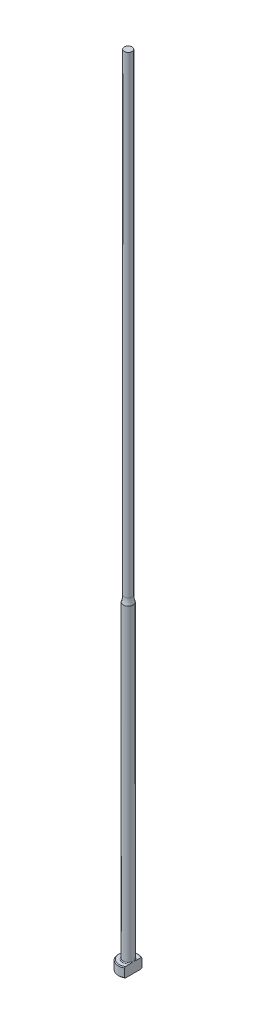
ISO-10303-21;
HEADER;
FILE_DESCRIPTION(('STEP AP214'),'2;1');
FILE_NAME('part.step','',(''),(''),'','','');
FILE_SCHEMA(('AUTOMOTIVE_DESIGN { 1 0 10303 214 1 1 1 1 }'));
ENDSEC;
DATA;
#1=APPLICATION_CONTEXT('core data for automotive mechanical design processes');
#2=APPLICATION_PROTOCOL_DEFINITION('international standard','automotive_design',2000,#1);
#3=PRODUCT_CONTEXT('',#1,'mechanical');
#4=PRODUCT('Part','Part','',(#3));
#5=PRODUCT_RELATED_PRODUCT_CATEGORY('part','',(#4));
#6=PRODUCT_DEFINITION_FORMATION('','',#4);
#7=PRODUCT_DEFINITION_CONTEXT('part definition',#1,'design');
#8=PRODUCT_DEFINITION('design','',#6,#7);
#9=PRODUCT_DEFINITION_SHAPE('','',#8);
#10=(LENGTH_UNIT() NAMED_UNIT(*) SI_UNIT(.MILLI.,.METRE.));
#11=(NAMED_UNIT(*) PLANE_ANGLE_UNIT() SI_UNIT($,.RADIAN.));
#12=(NAMED_UNIT(*) SI_UNIT($,.STERADIAN.) SOLID_ANGLE_UNIT());
#13=UNCERTAINTY_MEASURE_WITH_UNIT(LENGTH_MEASURE(1.E-05),#10,'distance_accuracy_value','');
#14=(GEOMETRIC_REPRESENTATION_CONTEXT(3) GLOBAL_UNCERTAINTY_ASSIGNED_CONTEXT((#13)) GLOBAL_UNIT_ASSIGNED_CONTEXT((#10,
#11,#12)) REPRESENTATION_CONTEXT('',''));
#15=CARTESIAN_POINT('',(0.,0.,0.));
#16=DIRECTION('',(0.,0.,1.));
#17=DIRECTION('',(1.,0.,0.));
#18=AXIS2_PLACEMENT_3D('',#15,#16,#17);
#19=CARTESIAN_POINT('',(-3.17499999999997,3.175,0.));
#20=DIRECTION('',(0.,1.,0.));
#21=DIRECTION('',(0.,0.,1.));
#22=AXIS2_PLACEMENT_3D('',#19,#20,#21);
#23=PLANE('',#22);
#24=CARTESIAN_POINT('',(0.,3.175,0.));
#25=DIRECTION('',(0.,1.,0.));
#26=DIRECTION('',(0.,0.,1.));
#27=AXIS2_PLACEMENT_3D('',#24,#25,#26);
#28=CIRCLE('',#27,2.92099999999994);
#29=CARTESIAN_POINT('',(1.58749999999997,3.175,-2.45195529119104));
#30=VERTEX_POINT('',#29);
#31=CARTESIAN_POINT('',(1.58749999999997,3.175,2.45195529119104));
#32=VERTEX_POINT('',#31);
#33=EDGE_CURVE('E105',#30,#32,#28,.T.);
#34=ORIENTED_EDGE('',*,*,#33,.T.);
#35=DIRECTION('',(0.,0.,1.));
#36=VECTOR('',#35,1.);
#37=CARTESIAN_POINT('',(1.58749999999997,3.17499999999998,2.74963065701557));
#38=LINE('',#37,#36);
#39=CARTESIAN_POINT('',(1.58749999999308,3.175,0.933255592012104));
#40=VERTEX_POINT('',#39);
#41=EDGE_CURVE('E126',#40,#32,#38,.T.);
#42=ORIENTED_EDGE('',*,*,#41,.F.);
#43=CARTESIAN_POINT('',(0.,3.175,0.));
#44=DIRECTION('',(0.,1.,0.));
#45=DIRECTION('',(0.,0.,1.));
#46=AXIS2_PLACEMENT_3D('',#43,#44,#45);
#47=CIRCLE('',#46,1.84149999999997);
#48=CARTESIAN_POINT('',(1.58749999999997,3.17500000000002,-0.933255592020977));
#49=VERTEX_POINT('',#48);
#50=EDGE_CURVE('E11',#40,#49,#47,.F.);
#51=ORIENTED_EDGE('',*,*,#50,.T.);
#52=EDGE_CURVE('E52',#30,#49,#38,.T.);
#53=ORIENTED_EDGE('',*,*,#52,.F.);
#54=EDGE_LOOP('',(#34,#42,#51,#53));
#55=FACE_BOUND('',#54,.T.);
#56=ADVANCED_FACE('F32',(#55),#23,.T.);
#57=CARTESIAN_POINT('',(0.,259.958771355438,0.));
#58=DIRECTION('',(0.,1.,0.));
#59=DIRECTION('',(0.,0.,1.));
#60=AXIS2_PLACEMENT_3D('',#57,#58,#59);
#61=CYLINDRICAL_SURFACE('',#60,3.17499999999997);
#62=CARTESIAN_POINT('',(0.,2.92100000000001,0.));
#63=DIRECTION('',(0.,1.,0.));
#64=DIRECTION('',(0.,0.,1.));
#65=AXIS2_PLACEMENT_3D('',#62,#63,#64);
#66=CIRCLE('',#65,3.17499999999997);
#67=CARTESIAN_POINT('',(1.58749999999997,2.92100000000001,2.74963065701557));
#68=VERTEX_POINT('',#67);
#69=CARTESIAN_POINT('',(1.58749999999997,2.92100000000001,-2.74963065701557));
#70=VERTEX_POINT('',#69);
#71=EDGE_CURVE('E98',#68,#70,#66,.F.);
#72=ORIENTED_EDGE('',*,*,#71,.T.);
#73=DIRECTION('',(0.,-1.,0.));
#74=VECTOR('',#73,1.);
#75=CARTESIAN_POINT('',(1.58749999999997,254.001,-2.74963065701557));
#76=LINE('',#75,#74);
#77=CARTESIAN_POINT('',(1.58749999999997,0.253999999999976,-2.74963065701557));
#78=VERTEX_POINT('',#77);
#79=EDGE_CURVE('E141',#70,#78,#76,.T.);
#80=ORIENTED_EDGE('',*,*,#79,.T.);
#81=CARTESIAN_POINT('',(0.,0.253999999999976,0.));
#82=DIRECTION('',(0.,-1.,0.));
#83=DIRECTION('',(0.,0.,-1.));
#84=AXIS2_PLACEMENT_3D('',#81,#82,#83);
#85=CIRCLE('',#84,3.17499999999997);
#86=CARTESIAN_POINT('',(1.58749999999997,0.253999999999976,2.74963065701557));
#87=VERTEX_POINT('',#86);
#88=EDGE_CURVE('E95',#78,#87,#85,.F.);
#89=ORIENTED_EDGE('',*,*,#88,.T.);
#90=DIRECTION('',(0.,-1.,0.));
#91=VECTOR('',#90,1.);
#92=CARTESIAN_POINT('',(1.58749999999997,254.001,2.74963065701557));
#93=LINE('',#92,#91);
#94=EDGE_CURVE('E88',#68,#87,#93,.T.);
#95=ORIENTED_EDGE('',*,*,#94,.F.);
#96=EDGE_LOOP('',(#72,#80,#89,#95));
#97=FACE_BOUND('',#96,.T.);
#98=ADVANCED_FACE('F191',(#97),#61,.T.);
#99=CARTESIAN_POINT('',(0.,0.,0.));
#100=DIRECTION('',(0.,-1.,0.));
#101=DIRECTION('',(0.,0.,-1.));
#102=AXIS2_PLACEMENT_3D('',#99,#100,#101);
#103=PLANE('',#102);
#104=CARTESIAN_POINT('',(0.,0.,0.));
#105=DIRECTION('',(0.,-1.,0.));
#106=DIRECTION('',(0.,0.,-1.));
#107=AXIS2_PLACEMENT_3D('',#104,#105,#106);
#108=CIRCLE('',#107,2.92100000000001);
#109=CARTESIAN_POINT('',(1.58749999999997,0.,2.45195529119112));
#110=VERTEX_POINT('',#109);
#111=CARTESIAN_POINT('',(1.58749999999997,0.,-2.45195529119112));
#112=VERTEX_POINT('',#111);
#113=EDGE_CURVE('E93',#110,#112,#108,.T.);
#114=ORIENTED_EDGE('',*,*,#113,.T.);
#115=DIRECTION('',(0.,0.,1.));
#116=VECTOR('',#115,1.);
#117=CARTESIAN_POINT('',(1.58749999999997,0.,2.74963065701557));
#118=LINE('',#117,#116);
#119=EDGE_CURVE('E78',#112,#110,#118,.T.);
#120=ORIENTED_EDGE('',*,*,#119,.T.);
#121=EDGE_LOOP('',(#114,#120));
#122=FACE_BOUND('',#121,.T.);
#123=ADVANCED_FACE('F97',(#122),#103,.T.);
#124=CARTESIAN_POINT('',(0.,3.17499999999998,0.));
#125=DIRECTION('',(0.,-1.,0.));
#126=DIRECTION('',(0.,0.,-1.));
#127=AXIS2_PLACEMENT_3D('',#124,#125,#126);
#128=CONICAL_SURFACE('',#127,2.92099999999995,0.785398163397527);
#129=ORIENTED_EDGE('',*,*,#71,.F.);
#130=CARTESIAN_POINT('',(1.58749999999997,-0.16162066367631,-6.0529050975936));
#131=CARTESIAN_POINT('',(1.58749999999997,-0.0288893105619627,-5.91567682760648));
#132=CARTESIAN_POINT('',(1.58749999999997,0.103699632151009,-5.7783103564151));
#133=CARTESIAN_POINT('',(1.58749999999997,0.368508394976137,-5.50321874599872));
#134=CARTESIAN_POINT('',(1.58749999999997,0.500728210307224,-5.36549360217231));
#135=CARTESIAN_POINT('',(1.58749999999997,0.764778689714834,-5.08953516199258));
#136=CARTESIAN_POINT('',(1.58749999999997,0.896609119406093,-4.9513016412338));
#137=CARTESIAN_POINT('',(1.58749999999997,1.15968706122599,-4.67428233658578));
#138=CARTESIAN_POINT('',(1.58749999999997,1.29093457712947,-4.53549655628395));
#139=CARTESIAN_POINT('',(1.58749999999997,1.55007705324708,-4.25997724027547));
#140=CARTESIAN_POINT('',(1.58749999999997,1.67798684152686,-4.12325766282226));
#141=CARTESIAN_POINT('',(1.58749999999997,1.9328486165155,-3.84892898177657));
#142=CARTESIAN_POINT('',(1.58749999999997,2.05980060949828,-3.71131988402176));
#143=CARTESIAN_POINT('',(1.58749999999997,2.31237508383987,-3.43493978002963));
#144=CARTESIAN_POINT('',(1.58749999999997,2.43799784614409,-3.29616903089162));
#145=CARTESIAN_POINT('',(1.58749999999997,2.68741369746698,-3.01699558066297));
#146=CARTESIAN_POINT('',(1.58749999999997,2.81120686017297,-2.8765929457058));
#147=CARTESIAN_POINT('',(1.58749999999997,3.00875865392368,-2.64816703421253));
#148=CARTESIAN_POINT('',(1.58749999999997,3.08336151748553,-2.56087478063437));
#149=CARTESIAN_POINT('',(1.58749999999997,3.2312387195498,-2.38515423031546));
#150=CARTESIAN_POINT('',(1.58749999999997,3.30451292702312,-2.29672582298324));
#151=CARTESIAN_POINT('',(1.58749999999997,3.45004422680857,-2.1174740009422));
#152=CARTESIAN_POINT('',(1.58749999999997,3.5222823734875,-2.02663514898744));
#153=CARTESIAN_POINT('',(1.58749999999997,3.66423097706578,-1.8430252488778));
#154=CARTESIAN_POINT('',(1.58749999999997,3.73394203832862,-1.75025467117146));
#155=CARTESIAN_POINT('',(1.58749999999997,3.87080633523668,-1.5606747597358));
#156=CARTESIAN_POINT('',(1.58749999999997,3.93790459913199,-1.46382547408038));
#157=CARTESIAN_POINT('',(1.58749999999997,4.06669147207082,-1.26632594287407));
#158=CARTESIAN_POINT('',(1.58749999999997,4.1283726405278,-1.16567073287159));
#159=CARTESIAN_POINT('',(1.58749999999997,4.21402252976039,-1.01165766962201));
#160=CARTESIAN_POINT('',(1.58749999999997,4.24127929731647,-0.960142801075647));
#161=CARTESIAN_POINT('',(1.58749999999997,4.2930979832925,-0.855780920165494));
#162=CARTESIAN_POINT('',(1.58749999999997,4.31765941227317,-0.802933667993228));
#163=CARTESIAN_POINT('',(1.58749999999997,4.38614656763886,-0.642461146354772));
#164=CARTESIAN_POINT('',(1.58749999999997,4.42510149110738,-0.532518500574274));
#165=CARTESIAN_POINT('',(1.58749999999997,4.46726244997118,-0.367680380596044));
#166=CARTESIAN_POINT('',(1.58749999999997,4.47844427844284,-0.314802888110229));
#167=CARTESIAN_POINT('',(1.58749999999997,4.49576654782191,-0.208209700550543));
#168=CARTESIAN_POINT('',(1.58749999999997,4.50190743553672,-0.154494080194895));
#169=CARTESIAN_POINT('',(1.58749999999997,4.50871296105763,-0.0468792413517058));
#170=CARTESIAN_POINT('',(1.58749999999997,4.5093945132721,0.00701889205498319));
#171=CARTESIAN_POINT('',(1.58749999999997,4.50527679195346,0.114606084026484));
#172=CARTESIAN_POINT('',(1.58749999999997,4.50047706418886,0.168295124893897));
#173=CARTESIAN_POINT('',(1.58749999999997,4.48579689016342,0.27448544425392));
#174=CARTESIAN_POINT('',(1.58749999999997,4.47596081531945,0.32699298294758));
#175=CARTESIAN_POINT('',(1.58749999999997,4.45181809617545,0.430974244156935));
#176=CARTESIAN_POINT('',(1.58749999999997,4.4375096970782,0.482447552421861));
#177=CARTESIAN_POINT('',(1.58749999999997,4.40502489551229,0.584460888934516));
#178=CARTESIAN_POINT('',(1.58749999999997,4.386827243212,0.634994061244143));
#179=CARTESIAN_POINT('',(1.58749999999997,4.34729308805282,0.734789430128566));
#180=CARTESIAN_POINT('',(1.58749999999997,4.3259572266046,0.784051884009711));
#181=CARTESIAN_POINT('',(1.58749999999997,4.25791922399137,0.930549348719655));
#182=CARTESIAN_POINT('',(1.58749999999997,4.20736047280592,1.0259880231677));
#183=CARTESIAN_POINT('',(1.58749999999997,4.0995545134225,1.21304313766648));
#184=CARTESIAN_POINT('',(1.58749999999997,4.04229912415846,1.30465471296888));
#185=CARTESIAN_POINT('',(1.58749999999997,3.92308746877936,1.48526211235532));
#186=CARTESIAN_POINT('',(1.58749999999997,3.86111349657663,1.57424615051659));
#187=CARTESIAN_POINT('',(1.58749999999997,3.73408621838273,1.74990003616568));
#188=CARTESIAN_POINT('',(1.58749999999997,3.66903444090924,1.83657099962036));
#189=CARTESIAN_POINT('',(1.58749999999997,3.53583371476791,2.00931764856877));
#190=CARTESIAN_POINT('',(1.58749999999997,3.46765527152,2.09537048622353));
#191=CARTESIAN_POINT('',(1.58749999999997,3.32960643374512,2.26611736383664));
#192=CARTESIAN_POINT('',(1.58749999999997,3.25973586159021,2.35081125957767));
#193=CARTESIAN_POINT('',(1.58749999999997,3.04858139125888,2.60290121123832));
#194=CARTESIAN_POINT('',(1.58749999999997,2.90542388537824,2.76872537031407));
#195=CARTESIAN_POINT('',(1.58749999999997,2.64069522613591,3.06970913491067));
#196=CARTESIAN_POINT('',(1.58749999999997,2.51959458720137,3.20528660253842));
#197=CARTESIAN_POINT('',(1.58749999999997,2.27590400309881,3.47510321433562));
#198=CARTESIAN_POINT('',(1.58749999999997,2.15331401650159,3.60934232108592));
#199=CARTESIAN_POINT('',(1.58749999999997,1.90694239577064,3.87695374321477));
#200=CARTESIAN_POINT('',(1.58749999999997,1.78315974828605,4.0103251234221));
#201=CARTESIAN_POINT('',(1.58749999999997,1.53478104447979,4.27630880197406));
#202=CARTESIAN_POINT('',(1.58749999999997,1.41018498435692,4.40892109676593));
#203=CARTESIAN_POINT('',(1.58749999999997,1.0457468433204,4.79499418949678));
#204=CARTESIAN_POINT('',(1.58749999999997,0.80507680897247,5.04767313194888));
#205=CARTESIAN_POINT('',(1.58749999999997,0.443121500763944,5.42550911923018));
#206=CARTESIAN_POINT('',(1.58749999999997,0.322378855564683,5.55118772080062));
#207=CARTESIAN_POINT('',(1.58749999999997,0.0805914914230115,5.80225207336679));
#208=CARTESIAN_POINT('',(1.58749999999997,-0.040453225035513,5.92763782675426));
#209=CARTESIAN_POINT('',(1.58749999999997,-0.161620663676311,6.0529050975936));
#210=B_SPLINE_CURVE_WITH_KNOTS('',3,(#130,#131,#132,#133,#134,#135,#136,#137,#138,#139,#140,
#141,#142,#143,#144,#145,#146,#147,#148,#149,#150,#151,#152,#153,#154,#155,#156,#157,#158,#159,
#160,#161,#162,#163,#164,#165,#166,#167,#168,#169,#170,#171,#172,#173,#174,#175,#176,#177,#178,
#179,#180,#181,#182,#183,#184,#185,#186,#187,#188,#189,#190,#191,#192,#193,#194,#195,#196,#197,
#198,#199,#200,#201,#202,#203,#204,#205,#206,#207,#208,#209),.UNSPECIFIED.,.F.,.F.,(4,2,2,2,2,2,
2,2,2,2,2,2,2,2,2,2,2,2,2,2,2,2,2,2,2,2,2,2,2,2,2,2,2,2,2,2,2,2,2,4),(0.,0.572750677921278,
1.14550874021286,1.71856057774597,2.29160869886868,2.85328006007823,3.4149477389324,
3.97649423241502,4.53801804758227,4.88249307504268,5.22700189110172,5.5751532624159,
5.92322081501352,6.27657800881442,6.63041319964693,6.80518126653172,6.9799810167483,
7.3282426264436,7.49018491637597,7.65211285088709,7.81353889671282,7.97497832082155,
8.13501929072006,8.29512313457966,8.45612518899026,8.61709438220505,8.94062993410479,
9.2645649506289,9.58978187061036,9.91483894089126,10.2441741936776,10.5735441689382,
11.2306812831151,11.7760337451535,12.3214014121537,12.8672825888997,13.4131663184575,
14.4600164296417,14.9828595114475,15.5056983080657),.UNSPECIFIED.);
#211=EDGE_CURVE('E118',#32,#68,#210,.T.);
#212=ORIENTED_EDGE('',*,*,#211,.F.);
#213=ORIENTED_EDGE('',*,*,#33,.F.);
#214=EDGE_CURVE('E117',#70,#30,#210,.T.);
#215=ORIENTED_EDGE('',*,*,#214,.F.);
#216=EDGE_LOOP('',(#129,#212,#213,#215));
#217=FACE_BOUND('',#216,.T.);
#218=ADVANCED_FACE('F162',(#217),#128,.T.);
#219=CARTESIAN_POINT('',(0.,0.253999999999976,0.));
#220=DIRECTION('',(0.,1.,0.));
#221=DIRECTION('',(0.,0.,1.));
#222=AXIS2_PLACEMENT_3D('',#219,#220,#221);
#223=CONICAL_SURFACE('',#222,3.17499999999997,0.785398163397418);
#224=ORIENTED_EDGE('',*,*,#88,.F.);
#225=CARTESIAN_POINT('',(1.58749999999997,3.33662066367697,6.0529050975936));
#226=CARTESIAN_POINT('',(1.58749999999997,3.20388931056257,5.91567682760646));
#227=CARTESIAN_POINT('',(1.58749999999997,3.07130036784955,5.77831035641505));
#228=CARTESIAN_POINT('',(1.58749999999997,2.80649160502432,5.50321874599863));
#229=CARTESIAN_POINT('',(1.58749999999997,2.67427178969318,5.3654936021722));
#230=CARTESIAN_POINT('',(1.58749999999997,2.41022131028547,5.08953516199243));
#231=CARTESIAN_POINT('',(1.58749999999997,2.27839088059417,4.95130164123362));
#232=CARTESIAN_POINT('',(1.58749999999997,2.01531293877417,4.67428233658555));
#233=CARTESIAN_POINT('',(1.58749999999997,1.88406542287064,4.5354965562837));
#234=CARTESIAN_POINT('',(1.58749999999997,1.62492294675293,4.25997724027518));
#235=CARTESIAN_POINT('',(1.58749999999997,1.49701315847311,4.12325766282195));
#236=CARTESIAN_POINT('',(1.58749999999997,1.24215138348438,3.84892898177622));
#237=CARTESIAN_POINT('',(1.58749999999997,1.11519939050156,3.71131988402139));
#238=CARTESIAN_POINT('',(1.58749999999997,0.862624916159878,3.43493978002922));
#239=CARTESIAN_POINT('',(1.58749999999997,0.737002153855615,3.29616903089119));
#240=CARTESIAN_POINT('',(1.58749999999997,0.487586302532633,3.01699558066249));
#241=CARTESIAN_POINT('',(1.58749999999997,0.363793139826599,2.8765929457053));
#242=CARTESIAN_POINT('',(1.58749999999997,0.166241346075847,2.64816703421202));
#243=CARTESIAN_POINT('',(1.58749999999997,0.0916384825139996,2.56087478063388));
#244=CARTESIAN_POINT('',(1.58749999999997,-0.0562387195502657,2.385154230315));
#245=CARTESIAN_POINT('',(1.58749999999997,-0.129512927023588,2.29672582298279));
#246=CARTESIAN_POINT('',(1.58749999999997,-0.27504422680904,2.11747400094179));
#247=CARTESIAN_POINT('',(1.58749999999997,-0.347282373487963,2.02663514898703));
#248=CARTESIAN_POINT('',(1.58749999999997,-0.489230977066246,1.84302524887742));
#249=CARTESIAN_POINT('',(1.58749999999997,-0.558942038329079,1.7502546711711));
#250=CARTESIAN_POINT('',(1.58749999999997,-0.695806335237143,1.56067475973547));
#251=CARTESIAN_POINT('',(1.58749999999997,-0.762904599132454,1.46382547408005));
#252=CARTESIAN_POINT('',(1.58749999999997,-0.891691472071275,1.26632594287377));
#253=CARTESIAN_POINT('',(1.58749999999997,-0.953372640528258,1.16567073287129));
#254=CARTESIAN_POINT('',(1.58749999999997,-1.03902252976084,1.01165766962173));
#255=CARTESIAN_POINT('',(1.58749999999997,-1.06627929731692,0.960142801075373));
#256=CARTESIAN_POINT('',(1.58749999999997,-1.11809798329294,0.85578092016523));
#257=CARTESIAN_POINT('',(1.58749999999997,-1.14265941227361,0.802933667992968));
#258=CARTESIAN_POINT('',(1.58749999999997,-1.21114656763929,0.642461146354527));
#259=CARTESIAN_POINT('',(1.58749999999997,-1.2501014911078,0.532518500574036));
#260=CARTESIAN_POINT('',(1.58749999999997,-1.29226244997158,0.367680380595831));
#261=CARTESIAN_POINT('',(1.58749999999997,-1.30344427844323,0.314802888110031));
#262=CARTESIAN_POINT('',(1.58749999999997,-1.32076654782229,0.208209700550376));
#263=CARTESIAN_POINT('',(1.58749999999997,-1.3269074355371,0.154494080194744));
#264=CARTESIAN_POINT('',(1.58749999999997,-1.333712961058,0.0468792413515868));
#265=CARTESIAN_POINT('',(1.58749999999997,-1.33439451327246,-0.00701889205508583));
#266=CARTESIAN_POINT('',(1.58749999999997,-1.33027679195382,-0.114606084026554));
#267=CARTESIAN_POINT('',(1.58749999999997,-1.32547706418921,-0.168295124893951));
#268=CARTESIAN_POINT('',(1.58749999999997,-1.31079689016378,-0.274485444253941));
#269=CARTESIAN_POINT('',(1.58749999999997,-1.3009608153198,-0.326992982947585));
#270=CARTESIAN_POINT('',(1.58749999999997,-1.27681809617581,-0.430974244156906));
#271=CARTESIAN_POINT('',(1.58749999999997,-1.26250969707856,-0.482447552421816));
#272=CARTESIAN_POINT('',(1.58749999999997,-1.23002489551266,-0.584460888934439));
#273=CARTESIAN_POINT('',(1.58749999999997,-1.21182724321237,-0.634994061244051));
#274=CARTESIAN_POINT('',(1.58749999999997,-1.1722930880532,-0.734789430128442));
#275=CARTESIAN_POINT('',(1.58749999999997,-1.15095722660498,-0.784051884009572));
#276=CARTESIAN_POINT('',(1.58749999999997,-1.08291922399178,-0.93054934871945));
#277=CARTESIAN_POINT('',(1.58749999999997,-1.03236047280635,-1.02598802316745));
#278=CARTESIAN_POINT('',(1.58749999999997,-0.924554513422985,-1.21304313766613));
#279=CARTESIAN_POINT('',(1.58749999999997,-0.86729912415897,-1.30465471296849));
#280=CARTESIAN_POINT('',(1.58749999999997,-0.748087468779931,-1.48526211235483));
#281=CARTESIAN_POINT('',(1.58749999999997,-0.686113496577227,-1.57424615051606));
#282=CARTESIAN_POINT('',(1.58749999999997,-0.55908621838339,-1.74990003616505));
#283=CARTESIAN_POINT('',(1.58749999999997,-0.494034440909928,-1.83657099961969));
#284=CARTESIAN_POINT('',(1.58749999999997,-0.360833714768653,-2.00931764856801));
#285=CARTESIAN_POINT('',(1.58749999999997,-0.292655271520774,-2.09537048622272));
#286=CARTESIAN_POINT('',(1.58749999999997,-0.154606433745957,-2.26611736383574));
#287=CARTESIAN_POINT('',(1.58749999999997,-0.0847358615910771,-2.35081125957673));
#288=CARTESIAN_POINT('',(1.58749999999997,0.126418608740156,-2.60290121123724));
#289=CARTESIAN_POINT('',(1.58749999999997,0.269576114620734,-2.76872537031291));
#290=CARTESIAN_POINT('',(1.58749999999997,0.534304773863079,-3.06970913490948));
#291=CARTESIAN_POINT('',(1.58749999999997,0.655405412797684,-3.20528660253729));
#292=CARTESIAN_POINT('',(1.58749999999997,0.899095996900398,-3.47510321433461));
#293=CARTESIAN_POINT('',(1.58749999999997,1.02168598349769,-3.60934232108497));
#294=CARTESIAN_POINT('',(1.58749999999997,1.26805760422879,-3.87695374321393));
#295=CARTESIAN_POINT('',(1.58749999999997,1.39184025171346,-4.01032512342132));
#296=CARTESIAN_POINT('',(1.58749999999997,1.64021895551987,-4.2763088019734));
#297=CARTESIAN_POINT('',(1.58749999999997,1.76481501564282,-4.40892109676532));
#298=CARTESIAN_POINT('',(1.58749999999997,2.12925315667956,-4.79499418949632));
#299=CARTESIAN_POINT('',(1.58749999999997,2.36992319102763,-5.04767313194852));
#300=CARTESIAN_POINT('',(1.58749999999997,2.73187849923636,-5.42550911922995));
#301=CARTESIAN_POINT('',(1.58749999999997,2.85262114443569,-5.55118772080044));
#302=CARTESIAN_POINT('',(1.58749999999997,3.09440850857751,-5.8022520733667));
#303=CARTESIAN_POINT('',(1.58749999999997,3.2154532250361,-5.92763782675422));
#304=CARTESIAN_POINT('',(1.58749999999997,3.33662066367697,-6.0529050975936));
#305=B_SPLINE_CURVE_WITH_KNOTS('',3,(#225,#226,#227,#228,#229,#230,#231,#232,#233,#234,#235,
#236,#237,#238,#239,#240,#241,#242,#243,#244,#245,#246,#247,#248,#249,#250,#251,#252,#253,#254,
#255,#256,#257,#258,#259,#260,#261,#262,#263,#264,#265,#266,#267,#268,#269,#270,#271,#272,#273,
#274,#275,#276,#277,#278,#279,#280,#281,#282,#283,#284,#285,#286,#287,#288,#289,#290,#291,#292,
#293,#294,#295,#296,#297,#298,#299,#300,#301,#302,#303,#304),.UNSPECIFIED.,.F.,.F.,(4,2,2,2,2,2,
2,2,2,2,2,2,2,2,2,2,2,2,2,2,2,2,2,2,2,2,2,2,2,2,2,2,2,2,2,2,2,2,2,4),(0.,0.57275067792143,
1.14550874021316,1.71856057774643,2.29160869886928,2.85328006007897,3.41494773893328,
3.97649423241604,4.53801804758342,4.88249307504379,5.2270018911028,5.57515326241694,
5.92322081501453,6.27657800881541,6.63041319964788,6.80518126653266,6.97998101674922,
7.32824262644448,7.49018491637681,7.65211285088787,7.81353889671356,7.97497832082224,
8.1350192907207,8.29512313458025,8.45612518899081,8.61709438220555,8.94062993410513,
9.26456495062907,9.58978187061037,9.91483894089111,10.2441741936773,10.5735441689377,
11.2306812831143,11.776033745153,12.3214014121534,12.8672825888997,13.4131663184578,
14.4600164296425,14.9828595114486,15.505698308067),.UNSPECIFIED.);
#306=EDGE_CURVE('E81',#112,#78,#305,.T.);
#307=ORIENTED_EDGE('',*,*,#306,.F.);
#308=ORIENTED_EDGE('',*,*,#113,.F.);
#309=EDGE_CURVE('E84',#87,#110,#305,.T.);
#310=ORIENTED_EDGE('',*,*,#309,.F.);
#311=EDGE_LOOP('',(#224,#307,#308,#310));
#312=FACE_BOUND('',#311,.T.);
#313=ADVANCED_FACE('F92',(#312),#223,.T.);
#314=CARTESIAN_POINT('',(0.,3.42900000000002,0.));
#315=DIRECTION('',(0.,1.,0.));
#316=DIRECTION('',(0.,0.,1.));
#317=AXIS2_PLACEMENT_3D('',#314,#315,#316);
#318=TOROIDAL_SURFACE('',#317,1.84149999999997,0.254);
#319=CARTESIAN_POINT('',(1.58749999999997,3.42900000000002,0.));
#320=CARTESIAN_POINT('',(1.58749999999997,3.42899942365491,-1.9220514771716E-10));
#321=CARTESIAN_POINT('',(1.58749999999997,3.42899884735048,-1.2261161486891E-07));
#322=CARTESIAN_POINT('',(1.58749999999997,3.42899773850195,-5.09676365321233E-07));
#323=CARTESIAN_POINT('',(1.58749999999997,3.42899720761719,-7.78176328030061E-07));
#324=CARTESIAN_POINT('',(1.58749999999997,3.42899614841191,-1.42307272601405E-06));
#325=CARTESIAN_POINT('',(1.58749999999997,3.42899562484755,-1.80713867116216E-06));
#326=CARTESIAN_POINT('',(1.58749999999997,3.42899463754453,-2.63494846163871E-06));
#327=CARTESIAN_POINT('',(1.58749999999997,3.42899417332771,-3.07814756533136E-06));
#328=CARTESIAN_POINT('',(1.58749999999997,3.42899261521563,-4.66897357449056E-06));
#329=CARTESIAN_POINT('',(1.58749999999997,3.42899159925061,-5.89404908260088E-06));
#330=CARTESIAN_POINT('',(1.58749999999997,3.42898979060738,-8.42427511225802E-06));
#331=CARTESIAN_POINT('',(1.58749999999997,3.42898899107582,-9.7248057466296E-06));
#332=CARTESIAN_POINT('',(1.58749999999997,3.42898598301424,-1.48060601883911E-05));
#333=CARTESIAN_POINT('',(1.58749999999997,3.42898393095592,-1.86838281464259E-05));
#334=CARTESIAN_POINT('',(1.58749999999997,3.42898057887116,-2.63261117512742E-05));
#335=CARTESIAN_POINT('',(1.58749999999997,3.42897922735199,-3.00687417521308E-05));
#336=CARTESIAN_POINT('',(1.58749999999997,3.42897347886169,-4.60276298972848E-05));
#337=CARTESIAN_POINT('',(1.58749999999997,3.42896911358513,-5.8247019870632E-05));
#338=CARTESIAN_POINT('',(1.58749999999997,3.42896211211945,-8.11070097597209E-05));
#339=CARTESIAN_POINT('',(1.58749999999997,3.42895931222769,-9.16953114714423E-05));
#340=CARTESIAN_POINT('',(1.58749999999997,3.42893712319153,-0.000168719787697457));
#341=CARTESIAN_POINT('',(1.58749999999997,3.42890881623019,-0.000232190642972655));
#342=CARTESIAN_POINT('',(1.58749999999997,3.42880276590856,-0.000479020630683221));
#343=CARTESIAN_POINT('',(1.58749999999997,3.42873165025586,-0.00066443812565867));
#344=CARTESIAN_POINT('',(1.58749999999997,3.42845137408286,-0.0013844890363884));
#345=CARTESIAN_POINT('',(1.58749999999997,3.42823526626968,-0.00191701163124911));
#346=CARTESIAN_POINT('',(1.58749999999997,3.42735449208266,-0.00409774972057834));
#347=CARTESIAN_POINT('',(1.58749999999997,3.42669768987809,-0.00574830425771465));
#348=CARTESIAN_POINT('',(1.58749999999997,3.4174405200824,-0.0289985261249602));
#349=CARTESIAN_POINT('',(1.58749999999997,3.40878325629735,-0.0505816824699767));
#350=CARTESIAN_POINT('',(1.58749999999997,3.39189297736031,-0.0929947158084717));
#351=CARTESIAN_POINT('',(1.58749999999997,3.38365605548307,-0.11382315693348));
#352=CARTESIAN_POINT('',(1.58749999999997,3.36635393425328,-0.157956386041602));
#353=CARTESIAN_POINT('',(1.58749999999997,3.35730391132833,-0.181267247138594));
#354=CARTESIAN_POINT('',(1.58749999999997,3.33936775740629,-0.228222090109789));
#355=CARTESIAN_POINT('',(1.58749999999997,3.33048420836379,-0.25186705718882));
#356=CARTESIAN_POINT('',(1.58749999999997,3.30894496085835,-0.310512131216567));
#357=CARTESIAN_POINT('',(1.58749999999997,3.29649449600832,-0.345588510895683));
#358=CARTESIAN_POINT('',(1.58749999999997,3.27296975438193,-0.415278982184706));
#359=CARTESIAN_POINT('',(1.58749999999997,3.26186987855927,-0.449884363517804));
#360=CARTESIAN_POINT('',(1.58749999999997,3.2395832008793,-0.524471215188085));
#361=CARTESIAN_POINT('',(1.58749999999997,3.22860862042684,-0.564517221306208));
#362=CARTESIAN_POINT('',(1.58749999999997,3.20902534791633,-0.645529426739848));
#363=CARTESIAN_POINT('',(1.58749999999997,3.20043582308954,-0.686500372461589));
#364=CARTESIAN_POINT('',(1.58749999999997,3.18611712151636,-0.771546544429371));
#365=CARTESIAN_POINT('',(1.58749999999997,3.18059550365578,-0.815658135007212));
#366=CARTESIAN_POINT('',(1.58749999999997,3.17455396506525,-0.904117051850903));
#367=CARTESIAN_POINT('',(1.58749999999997,3.17401361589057,-0.948462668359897));
#368=CARTESIAN_POINT('',(1.58749999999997,3.17898948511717,-1.02531896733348));
#369=CARTESIAN_POINT('',(1.58749999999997,3.1829739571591,-1.05792141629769));
#370=CARTESIAN_POINT('',(1.58749999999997,3.19569167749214,-1.12184393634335));
#371=CARTESIAN_POINT('',(1.58749999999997,3.20436049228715,-1.1531753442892));
#372=CARTESIAN_POINT('',(1.58749999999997,3.22236152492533,-1.19946468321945));
#373=CARTESIAN_POINT('',(1.58749999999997,3.2295150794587,-1.21526783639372));
#374=CARTESIAN_POINT('',(1.58749999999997,3.24587062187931,-1.24583726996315));
#375=CARTESIAN_POINT('',(1.58749999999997,3.25507530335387,-1.26060215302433));
#376=CARTESIAN_POINT('',(1.58749999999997,3.27378481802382,-1.28575815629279));
#377=CARTESIAN_POINT('',(1.58749999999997,3.28289001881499,-1.29644383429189));
#378=CARTESIAN_POINT('',(1.58749999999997,3.30268460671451,-1.31623154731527));
#379=CARTESIAN_POINT('',(1.58749999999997,3.31337067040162,-1.32533681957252));
#380=CARTESIAN_POINT('',(1.58749999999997,3.33349977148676,-1.33941140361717));
#381=CARTESIAN_POINT('',(1.58749999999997,3.34261446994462,-1.34484814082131));
#382=CARTESIAN_POINT('',(1.58749999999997,3.36161455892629,-1.35416329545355));
#383=CARTESIAN_POINT('',(1.58749999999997,3.37149946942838,-1.35804267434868));
#384=CARTESIAN_POINT('',(1.58749999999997,3.39188678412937,-1.36398436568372));
#385=CARTESIAN_POINT('',(1.58749999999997,3.40239309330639,-1.36603350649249));
#386=CARTESIAN_POINT('',(1.58749999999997,3.42360372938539,-1.3680840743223));
#387=CARTESIAN_POINT('',(1.58749999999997,3.43430795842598,-1.36808648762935));
#388=CARTESIAN_POINT('',(1.58749999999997,3.45433283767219,-1.36616208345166));
#389=CARTESIAN_POINT('',(1.58749999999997,3.46367506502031,-1.36444960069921));
#390=CARTESIAN_POINT('',(1.58749999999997,3.48195519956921,-1.35953338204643));
#391=CARTESIAN_POINT('',(1.58749999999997,3.49089304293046,-1.3563294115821));
#392=CARTESIAN_POINT('',(1.58749999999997,3.50850302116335,-1.34848006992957));
#393=CARTESIAN_POINT('',(1.58749999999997,3.5171531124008,-1.34378578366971));
#394=CARTESIAN_POINT('',(1.58749999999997,3.53371257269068,-1.33324445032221));
#395=CARTESIAN_POINT('',(1.58749999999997,3.54162163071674,-1.32739692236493));
#396=CARTESIAN_POINT('',(1.58749999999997,3.56107121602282,-1.31107304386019));
#397=CARTESIAN_POINT('',(1.58749999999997,3.57202221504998,-1.29989286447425));
#398=CARTESIAN_POINT('',(1.58749999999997,3.59202509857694,-1.27593566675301));
#399=CARTESIAN_POINT('',(1.58749999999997,3.60107086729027,-1.26315370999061));
#400=CARTESIAN_POINT('',(1.58749999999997,3.62186023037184,-1.22930733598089));
#401=CARTESIAN_POINT('',(1.58749999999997,3.63240584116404,-1.20751096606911));
#402=CARTESIAN_POINT('',(1.58749999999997,3.65004643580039,-1.16266144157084));
#403=CARTESIAN_POINT('',(1.58749999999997,3.65714435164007,-1.13960937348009));
#404=CARTESIAN_POINT('',(1.58749999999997,3.67265428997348,-1.07603916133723));
#405=CARTESIAN_POINT('',(1.58749999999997,3.67834921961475,-1.03486686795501));
#406=CARTESIAN_POINT('',(1.58749999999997,3.68382880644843,-0.951558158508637));
#407=CARTESIAN_POINT('',(1.58749999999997,3.68350976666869,-0.909417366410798));
#408=CARTESIAN_POINT('',(1.58749999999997,3.67745397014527,-0.811383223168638));
#409=CARTESIAN_POINT('',(1.58749999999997,3.66993873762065,-0.755610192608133));
#410=CARTESIAN_POINT('',(1.58749999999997,3.64933373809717,-0.644937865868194));
#411=CARTESIAN_POINT('',(1.58749999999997,3.63621897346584,-0.59004364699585));
#412=CARTESIAN_POINT('',(1.58749999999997,3.60740922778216,-0.485757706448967));
#413=CARTESIAN_POINT('',(1.58749999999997,3.59201096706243,-0.436281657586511));
#414=CARTESIAN_POINT('',(1.58749999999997,3.55922497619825,-0.338551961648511));
#415=CARTESIAN_POINT('',(1.58749999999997,3.5418584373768,-0.290291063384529));
#416=CARTESIAN_POINT('',(1.58749999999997,3.51760237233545,-0.225557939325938));
#417=CARTESIAN_POINT('',(1.58749999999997,3.51126413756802,-0.208874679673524));
#418=CARTESIAN_POINT('',(1.58749999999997,3.49830042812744,-0.17512392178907));
#419=CARTESIAN_POINT('',(1.58749999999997,3.49167176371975,-0.158057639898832));
#420=CARTESIAN_POINT('',(1.58749999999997,3.47585523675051,-0.117638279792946));
#421=CARTESIAN_POINT('',(1.58749999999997,3.46662970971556,-0.0943002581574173));
#422=CARTESIAN_POINT('',(1.58749999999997,3.44889695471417,-0.0497824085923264));
#423=CARTESIAN_POINT('',(1.58749999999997,3.44040039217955,-0.028598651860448));
#424=CARTESIAN_POINT('',(1.58749999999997,3.43130364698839,-0.00575168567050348));
#425=CARTESIAN_POINT('',(1.58749999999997,3.43064818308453,-0.00410451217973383));
#426=CARTESIAN_POINT('',(1.58749999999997,3.42976776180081,-0.00192459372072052));
#427=CARTESIAN_POINT('',(1.58749999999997,3.42955062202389,-0.00138952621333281));
#428=CARTESIAN_POINT('',(1.58749999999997,3.42926908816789,-0.000666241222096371));
#429=CARTESIAN_POINT('',(1.58749999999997,3.42919771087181,-0.000480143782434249));
#430=CARTESIAN_POINT('',(1.58749999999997,3.42909131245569,-0.000232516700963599));
#431=CARTESIAN_POINT('',(1.58749999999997,3.42906294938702,-0.000168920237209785));
#432=CARTESIAN_POINT('',(1.58749999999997,3.42904072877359,-9.17527162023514E-05));
#433=CARTESIAN_POINT('',(1.58749999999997,3.42903792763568,-8.11550293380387E-05));
#434=CARTESIAN_POINT('',(1.58749999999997,3.42903091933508,-5.82743948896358E-05));
#435=CARTESIAN_POINT('',(1.58749999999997,3.42902654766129,-4.60440001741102E-05));
#436=CARTESIAN_POINT('',(1.58749999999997,3.42902079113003,-3.00727682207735E-05));
#437=CARTESIAN_POINT('',(1.58749999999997,3.42901943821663,-2.63286807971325E-05));
#438=CARTESIAN_POINT('',(1.58749999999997,3.42901608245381,-1.86836529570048E-05));
#439=CARTESIAN_POINT('',(1.58749999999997,3.4290140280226,-1.48046517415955E-05));
#440=CARTESIAN_POINT('',(1.58749999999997,3.42901101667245,-9.72223943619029E-06));
#441=CARTESIAN_POINT('',(1.58749999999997,3.42901021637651,-8.42159649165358E-06));
#442=CARTESIAN_POINT('',(1.58749999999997,3.42900840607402,-5.89129729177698E-06));
#443=CARTESIAN_POINT('',(1.58749999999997,3.42900738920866,-4.66626867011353E-06));
#444=CARTESIAN_POINT('',(1.58749999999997,3.42900582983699,-3.07568803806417E-06));
#445=CARTESIAN_POINT('',(1.58749999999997,3.42900536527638,-2.63259565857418E-06));
#446=CARTESIAN_POINT('',(1.58749999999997,3.4290043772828,-1.80506085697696E-06));
#447=CARTESIAN_POINT('',(1.58749999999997,3.42900385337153,-1.42116387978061E-06));
#448=CARTESIAN_POINT('',(1.58749999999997,3.42900279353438,-7.76675643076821E-07));
#449=CARTESIAN_POINT('',(1.58749999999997,3.42900226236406,-5.08406487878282E-07));
#450=CARTESIAN_POINT('',(1.58749999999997,3.42900115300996,-1.21901887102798E-07));
#451=CARTESIAN_POINT('',(1.58749999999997,3.42900057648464,1.92251677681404E-10));
#452=CARTESIAN_POINT('',(1.58749999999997,3.42900000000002,0.));
#453=B_SPLINE_CURVE_WITH_KNOTS('',3,(#319,#320,#321,#322,#323,#324,#325,#326,#327,#328,#329,
#330,#331,#332,#333,#334,#335,#336,#337,#338,#339,#340,#341,#342,#343,#344,#345,#346,#347,#348,
#349,#350,#351,#352,#353,#354,#355,#356,#357,#358,#359,#360,#361,#362,#363,#364,#365,#366,#367,
#368,#369,#370,#371,#372,#373,#374,#375,#376,#377,#378,#379,#380,#381,#382,#383,#384,#385,#386,
#387,#388,#389,#390,#391,#392,#393,#394,#395,#396,#397,#398,#399,#400,#401,#402,#403,#404,#405,
#406,#407,#408,#409,#410,#411,#412,#413,#414,#415,#416,#417,#418,#419,#420,#421,#422,#423,#424,
#425,#426,#427,#428,#429,#430,#431,#432,#433,#434,#435,#436,#437,#438,#439,#440,#441,#442,#443,
#444,#445,#446,#447,#448,#449,#450,#451,#452),.UNSPECIFIED.,.T.,.F.,(4,2,2,2,2,2,2,2,2,2,2,2,2,
2,2,2,2,2,2,2,2,2,2,2,2,2,2,2,2,2,2,2,2,2,2,2,2,2,2,2,2,2,2,2,2,2,2,2,2,2,2,2,2,2,2,2,2,2,2,2,2,
2,2,2,2,2,4),(0.,1.72815458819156E-06,3.50429255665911E-06,5.44431004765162E-06,
7.3675525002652E-06,1.2119089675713E-05,1.66953775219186E-05,2.98160400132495E-05,
4.17409564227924E-05,8.0660475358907E-05,0.000113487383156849,0.000321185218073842,
0.000917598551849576,0.00264089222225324,0.00797105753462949,0.0777276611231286,
0.144923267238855,0.219939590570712,0.295714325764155,0.407362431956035,0.516367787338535,
0.640878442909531,0.766362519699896,0.899536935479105,1.03216495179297,1.13045740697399,
1.22743103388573,1.27935899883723,1.33135556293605,1.37333248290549,1.41522237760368,
1.44693946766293,1.47863694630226,1.51056074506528,1.54246916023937,1.57083210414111,
1.59919951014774,1.62861579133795,1.65804436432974,1.70472658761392,1.75155645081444,
1.82378709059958,1.89595619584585,2.01995471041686,2.1460932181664,2.31447224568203,
2.48361094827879,2.6389891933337,2.79283011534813,2.84637031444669,2.9012946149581,
2.97658236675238,3.04504771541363,3.05036697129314,3.05209849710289,3.05269709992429,
3.05290520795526,3.05293806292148,3.05297701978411,3.05298895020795,3.05300207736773,
3.05300665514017,3.0530114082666,3.05301333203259,3.05301527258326,3.05301704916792,
3.05301877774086),.UNSPECIFIED.);
#454=CARTESIAN_POINT('',(1.58749999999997,3.42900000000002,0.));
#455=VERTEX_POINT('',#454);
#456=EDGE_CURVE('E47',#455,#49,#453,.T.);
#457=ORIENTED_EDGE('',*,*,#456,.T.);
#458=ORIENTED_EDGE('',*,*,#50,.F.);
#459=CARTESIAN_POINT('',(1.58749999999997,3.42900000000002,0.));
#460=CARTESIAN_POINT('',(1.58749999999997,3.42900057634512,1.9220512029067E-10));
#461=CARTESIAN_POINT('',(1.58749999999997,3.42900115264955,1.22611614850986E-07));
#462=CARTESIAN_POINT('',(1.58749999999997,3.42900226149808,5.09676365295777E-07));
#463=CARTESIAN_POINT('',(1.58749999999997,3.42900279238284,7.78176328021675E-07));
#464=CARTESIAN_POINT('',(1.58749999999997,3.42900385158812,1.42307272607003E-06));
#465=CARTESIAN_POINT('',(1.58749999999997,3.42900437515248,1.80713867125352E-06));
#466=CARTESIAN_POINT('',(1.58749999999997,3.4290053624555,2.63494846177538E-06));
#467=CARTESIAN_POINT('',(1.58749999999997,3.42900582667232,3.0781475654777E-06));
#468=CARTESIAN_POINT('',(1.58749999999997,3.4290073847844,4.66897357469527E-06));
#469=CARTESIAN_POINT('',(1.58749999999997,3.42900840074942,5.89404908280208E-06));
#470=CARTESIAN_POINT('',(1.58749999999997,3.42901020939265,8.42427511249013E-06));
#471=CARTESIAN_POINT('',(1.58749999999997,3.42901100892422,9.72480574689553E-06));
#472=CARTESIAN_POINT('',(1.58749999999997,3.42901401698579,1.48060601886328E-05));
#473=CARTESIAN_POINT('',(1.58749999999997,3.42901606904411,1.86838281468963E-05));
#474=CARTESIAN_POINT('',(1.58749999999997,3.42901942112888,2.63261117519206E-05));
#475=CARTESIAN_POINT('',(1.58749999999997,3.42902077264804,3.00687417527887E-05));
#476=CARTESIAN_POINT('',(1.58749999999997,3.42902652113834,4.60276298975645E-05));
#477=CARTESIAN_POINT('',(1.58749999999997,3.4290308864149,5.82470198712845E-05));
#478=CARTESIAN_POINT('',(1.58749999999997,3.42903788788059,8.11070097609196E-05));
#479=CARTESIAN_POINT('',(1.58749999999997,3.42904068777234,9.16953114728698E-05));
#480=CARTESIAN_POINT('',(1.58749999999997,3.4290628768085,0.000168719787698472));
#481=CARTESIAN_POINT('',(1.58749999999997,3.42909118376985,0.000232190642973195));
#482=CARTESIAN_POINT('',(1.58749999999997,3.42919723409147,0.000479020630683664));
#483=CARTESIAN_POINT('',(1.58749999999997,3.42926834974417,0.000664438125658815));
#484=CARTESIAN_POINT('',(1.58749999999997,3.42954862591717,0.00138448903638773));
#485=CARTESIAN_POINT('',(1.58749999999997,3.42976473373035,0.00191701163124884));
#486=CARTESIAN_POINT('',(1.58749999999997,3.43064550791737,0.00409774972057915));
#487=CARTESIAN_POINT('',(1.58749999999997,3.43130231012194,0.00574830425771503));
#488=CARTESIAN_POINT('',(1.58749999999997,3.44055947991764,0.0289985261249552));
#489=CARTESIAN_POINT('',(1.58749999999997,3.44921674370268,0.0505816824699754));
#490=CARTESIAN_POINT('',(1.58749999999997,3.46610702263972,0.0929947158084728));
#491=CARTESIAN_POINT('',(1.58749999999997,3.47434394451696,0.11382315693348));
#492=CARTESIAN_POINT('',(1.58749999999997,3.49164606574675,0.157956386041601));
#493=CARTESIAN_POINT('',(1.58749999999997,3.5006960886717,0.181267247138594));
#494=CARTESIAN_POINT('',(1.58749999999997,3.51863224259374,0.228222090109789));
#495=CARTESIAN_POINT('',(1.58749999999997,3.52751579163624,0.25186705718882));
#496=CARTESIAN_POINT('',(1.58749999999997,3.54905503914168,0.310512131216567));
#497=CARTESIAN_POINT('',(1.58749999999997,3.56150550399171,0.345588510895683));
#498=CARTESIAN_POINT('',(1.58749999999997,3.5850302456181,0.415278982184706));
#499=CARTESIAN_POINT('',(1.58749999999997,3.59613012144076,0.449884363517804));
#500=CARTESIAN_POINT('',(1.58749999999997,3.61841679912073,0.524471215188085));
#501=CARTESIAN_POINT('',(1.58749999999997,3.62939137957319,0.564517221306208));
#502=CARTESIAN_POINT('',(1.58749999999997,3.6489746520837,0.645529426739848));
#503=CARTESIAN_POINT('',(1.58749999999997,3.65756417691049,0.686500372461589));
#504=CARTESIAN_POINT('',(1.58749999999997,3.67188287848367,0.771546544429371));
#505=CARTESIAN_POINT('',(1.58749999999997,3.67740449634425,0.815658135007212));
#506=CARTESIAN_POINT('',(1.58749999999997,3.68344603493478,0.904117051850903));
#507=CARTESIAN_POINT('',(1.58749999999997,3.68398638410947,0.948462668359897));
#508=CARTESIAN_POINT('',(1.58749999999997,3.67901051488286,1.02531896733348));
#509=CARTESIAN_POINT('',(1.58749999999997,3.67502604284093,1.05792141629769));
#510=CARTESIAN_POINT('',(1.58749999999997,3.66230832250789,1.12184393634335));
#511=CARTESIAN_POINT('',(1.58749999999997,3.65363950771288,1.1531753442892));
#512=CARTESIAN_POINT('',(1.58749999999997,3.6356384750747,1.19946468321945));
#513=CARTESIAN_POINT('',(1.58749999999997,3.62848492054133,1.21526783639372));
#514=CARTESIAN_POINT('',(1.58749999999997,3.61212937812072,1.24583726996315));
#515=CARTESIAN_POINT('',(1.58749999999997,3.60292469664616,1.26060215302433));
#516=CARTESIAN_POINT('',(1.58749999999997,3.58421518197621,1.28575815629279));
#517=CARTESIAN_POINT('',(1.58749999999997,3.57510998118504,1.29644383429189));
#518=CARTESIAN_POINT('',(1.58749999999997,3.55531539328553,1.31623154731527));
#519=CARTESIAN_POINT('',(1.58749999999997,3.54462932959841,1.32533681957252));
#520=CARTESIAN_POINT('',(1.58749999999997,3.52450022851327,1.33941140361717));
#521=CARTESIAN_POINT('',(1.58749999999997,3.51538553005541,1.34484814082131));
#522=CARTESIAN_POINT('',(1.58749999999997,3.49638544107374,1.35416329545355));
#523=CARTESIAN_POINT('',(1.58749999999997,3.48650053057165,1.35804267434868));
#524=CARTESIAN_POINT('',(1.58749999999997,3.46611321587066,1.36398436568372));
#525=CARTESIAN_POINT('',(1.58749999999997,3.45560690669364,1.36603350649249));
#526=CARTESIAN_POINT('',(1.58749999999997,3.43439627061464,1.3680840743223));
#527=CARTESIAN_POINT('',(1.58749999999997,3.42369204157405,1.36808648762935));
#528=CARTESIAN_POINT('',(1.58749999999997,3.40366716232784,1.36616208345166));
#529=CARTESIAN_POINT('',(1.58749999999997,3.39432493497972,1.36444960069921));
#530=CARTESIAN_POINT('',(1.58749999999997,3.37604480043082,1.35953338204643));
#531=CARTESIAN_POINT('',(1.58749999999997,3.36710695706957,1.3563294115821));
#532=CARTESIAN_POINT('',(1.58749999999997,3.34949697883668,1.34848006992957));
#533=CARTESIAN_POINT('',(1.58749999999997,3.34084688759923,1.34378578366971));
#534=CARTESIAN_POINT('',(1.58749999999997,3.32428742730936,1.33324445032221));
#535=CARTESIAN_POINT('',(1.58749999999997,3.31637836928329,1.32739692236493));
#536=CARTESIAN_POINT('',(1.58749999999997,3.29692878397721,1.31107304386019));
#537=CARTESIAN_POINT('',(1.58749999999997,3.28597778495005,1.29989286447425));
#538=CARTESIAN_POINT('',(1.58749999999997,3.26597490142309,1.27593566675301));
#539=CARTESIAN_POINT('',(1.58749999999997,3.25692913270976,1.26315370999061));
#540=CARTESIAN_POINT('',(1.58749999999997,3.23613976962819,1.22930733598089));
#541=CARTESIAN_POINT('',(1.58749999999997,3.22559415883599,1.20751096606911));
#542=CARTESIAN_POINT('',(1.58749999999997,3.20795356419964,1.16266144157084));
#543=CARTESIAN_POINT('',(1.58749999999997,3.20085564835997,1.13960937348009));
#544=CARTESIAN_POINT('',(1.58749999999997,3.18534571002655,1.07603916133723));
#545=CARTESIAN_POINT('',(1.58749999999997,3.17965078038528,1.03486686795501));
#546=CARTESIAN_POINT('',(1.58749999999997,3.1741711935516,0.951558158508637));
#547=CARTESIAN_POINT('',(1.58749999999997,3.17449023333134,0.909417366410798));
#548=CARTESIAN_POINT('',(1.58749999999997,3.18054602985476,0.811383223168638));
#549=CARTESIAN_POINT('',(1.58749999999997,3.18806126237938,0.755610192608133));
#550=CARTESIAN_POINT('',(1.58749999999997,3.20866626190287,0.644937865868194));
#551=CARTESIAN_POINT('',(1.58749999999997,3.2217810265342,0.59004364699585));
#552=CARTESIAN_POINT('',(1.58749999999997,3.25059077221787,0.485757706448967));
#553=CARTESIAN_POINT('',(1.58749999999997,3.2659890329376,0.43628165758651));
#554=CARTESIAN_POINT('',(1.58749999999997,3.29877502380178,0.338551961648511));
#555=CARTESIAN_POINT('',(1.58749999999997,3.31614156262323,0.290291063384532));
#556=CARTESIAN_POINT('',(1.58749999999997,3.34039762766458,0.225557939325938));
#557=CARTESIAN_POINT('',(1.58749999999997,3.346735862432,0.208874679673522));
#558=CARTESIAN_POINT('',(1.58749999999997,3.35969957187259,0.175123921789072));
#559=CARTESIAN_POINT('',(1.58749999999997,3.3663282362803,0.15805763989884));
#560=CARTESIAN_POINT('',(1.58749999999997,3.3821447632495,0.117638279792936));
#561=CARTESIAN_POINT('',(1.58749999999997,3.39137029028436,0.0943002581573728));
#562=CARTESIAN_POINT('',(1.58749999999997,3.40910304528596,0.0497824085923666));
#563=CARTESIAN_POINT('',(1.58749999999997,3.41759960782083,0.0285986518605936));
#564=CARTESIAN_POINT('',(1.58749999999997,3.42669635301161,0.00575168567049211));
#565=CARTESIAN_POINT('',(1.58749999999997,3.42735181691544,0.00410451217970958));
#566=CARTESIAN_POINT('',(1.58749999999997,3.42823223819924,0.00192459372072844));
#567=CARTESIAN_POINT('',(1.58749999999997,3.42844937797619,0.00138952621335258));
#568=CARTESIAN_POINT('',(1.58749999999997,3.42873091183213,0.000666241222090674));
#569=CARTESIAN_POINT('',(1.58749999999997,3.42880228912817,0.000480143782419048));
#570=CARTESIAN_POINT('',(1.58749999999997,3.42890868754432,0.000232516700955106));
#571=CARTESIAN_POINT('',(1.58749999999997,3.42893705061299,0.000168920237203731));
#572=CARTESIAN_POINT('',(1.58749999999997,3.42895927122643,9.17527161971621E-05));
#573=CARTESIAN_POINT('',(1.58749999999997,3.42896207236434,8.1155029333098E-05));
#574=CARTESIAN_POINT('',(1.58749999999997,3.42896908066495,5.82743948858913E-05));
#575=CARTESIAN_POINT('',(1.58749999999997,3.42897345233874,4.60440001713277E-05));
#576=CARTESIAN_POINT('',(1.58749999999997,3.42897920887,3.00727682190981E-05));
#577=CARTESIAN_POINT('',(1.58749999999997,3.42898056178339,2.63286807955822E-05));
#578=CARTESIAN_POINT('',(1.58749999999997,3.42898391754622,1.86836529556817E-05));
#579=CARTESIAN_POINT('',(1.58749999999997,3.42898597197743,1.48046517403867E-05));
#580=CARTESIAN_POINT('',(1.58749999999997,3.42898898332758,9.72223943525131E-06));
#581=CARTESIAN_POINT('',(1.58749999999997,3.42898978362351,8.42159649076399E-06));
#582=CARTESIAN_POINT('',(1.58749999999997,3.42899159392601,5.89129729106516E-06));
#583=CARTESIAN_POINT('',(1.58749999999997,3.42899261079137,4.66626866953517E-06));
#584=CARTESIAN_POINT('',(1.58749999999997,3.42899417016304,3.0756880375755E-06));
#585=CARTESIAN_POINT('',(1.58749999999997,3.42899463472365,2.63259565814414E-06));
#586=CARTESIAN_POINT('',(1.58749999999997,3.42899562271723,1.80506085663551E-06));
#587=CARTESIAN_POINT('',(1.58749999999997,3.42899614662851,1.42116387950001E-06));
#588=CARTESIAN_POINT('',(1.58749999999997,3.42899720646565,7.7667564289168E-07));
#589=CARTESIAN_POINT('',(1.58749999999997,3.42899773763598,5.0840648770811E-07));
#590=CARTESIAN_POINT('',(1.58749999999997,3.42899884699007,1.21901887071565E-07));
#591=CARTESIAN_POINT('',(1.58749999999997,3.42899942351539,-1.92251650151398E-10));
#592=CARTESIAN_POINT('',(1.58749999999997,3.42900000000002,0.));
#593=B_SPLINE_CURVE_WITH_KNOTS('',3,(#459,#460,#461,#462,#463,#464,#465,#466,#467,#468,#469,
#470,#471,#472,#473,#474,#475,#476,#477,#478,#479,#480,#481,#482,#483,#484,#485,#486,#487,#488,
#489,#490,#491,#492,#493,#494,#495,#496,#497,#498,#499,#500,#501,#502,#503,#504,#505,#506,#507,
#508,#509,#510,#511,#512,#513,#514,#515,#516,#517,#518,#519,#520,#521,#522,#523,#524,#525,#526,
#527,#528,#529,#530,#531,#532,#533,#534,#535,#536,#537,#538,#539,#540,#541,#542,#543,#544,#545,
#546,#547,#548,#549,#550,#551,#552,#553,#554,#555,#556,#557,#558,#559,#560,#561,#562,#563,#564,
#565,#566,#567,#568,#569,#570,#571,#572,#573,#574,#575,#576,#577,#578,#579,#580,#581,#582,#583,
#584,#585,#586,#587,#588,#589,#590,#591,#592),.UNSPECIFIED.,.T.,.F.,(4,2,2,2,2,2,2,2,2,2,2,2,2,
2,2,2,2,2,2,2,2,2,2,2,2,2,2,2,2,2,2,2,2,2,2,2,2,2,2,2,2,2,2,2,2,2,2,2,2,2,2,2,2,2,2,2,2,2,2,2,2,
2,2,2,2,2,4),(0.,1.72815458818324E-06,3.50429255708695E-06,5.44431004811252E-06,
7.36755250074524E-06,1.21190896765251E-05,1.66953775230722E-05,2.98160400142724E-05,
4.17409564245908E-05,8.06604753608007E-05,0.000113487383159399,0.000321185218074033,
0.000917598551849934,0.00264089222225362,0.00797105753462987,0.077727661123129,
0.144923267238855,0.219939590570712,0.295714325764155,0.407362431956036,0.516367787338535,
0.640878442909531,0.766362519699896,0.899536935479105,1.03216495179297,1.13045740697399,
1.22743103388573,1.27935899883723,1.33135556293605,1.37333248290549,1.41522237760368,
1.44693946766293,1.47863694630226,1.51056074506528,1.54246916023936,1.57083210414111,
1.59919951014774,1.62861579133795,1.65804436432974,1.70472658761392,1.75155645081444,
1.82378709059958,1.89595619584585,2.01995471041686,2.1460932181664,2.31447224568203,
2.48361094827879,2.6389891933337,2.79283011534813,2.84637031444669,2.9012946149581,
2.97658236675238,3.04504771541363,3.05036697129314,3.05209849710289,3.05269709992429,
3.05290520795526,3.05293806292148,3.05297701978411,3.05298895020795,3.05300207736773,
3.05300665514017,3.0530114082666,3.05301333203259,3.05301527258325,3.05301704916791,
3.05301877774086),.UNSPECIFIED.);
#594=EDGE_CURVE('E147',#40,#455,#593,.T.);
#595=ORIENTED_EDGE('',*,*,#594,.T.);
#596=CARTESIAN_POINT('',(0.,3.42900000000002,0.));
#597=DIRECTION('',(0.,1.,0.));
#598=DIRECTION('',(0.,0.,1.));
#599=AXIS2_PLACEMENT_3D('',#596,#597,#598);
#600=CIRCLE('',#599,1.58749999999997);
#601=EDGE_CURVE('E40',#455,#455,#600,.T.);
#602=ORIENTED_EDGE('',*,*,#601,.F.);
#603=EDGE_LOOP('',(#457,#458,#595,#602));
#604=FACE_BOUND('',#603,.T.);
#605=ADVANCED_FACE('F34',(#604),#318,.F.);
#606=CARTESIAN_POINT('',(-1.25348999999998,254.,0.));
#607=DIRECTION('',(0.,1.,0.));
#608=DIRECTION('',(0.,0.,1.));
#609=AXIS2_PLACEMENT_3D('',#606,#607,#608);
#610=PLANE('',#609);
#611=CARTESIAN_POINT('',(0.,254.,0.));
#612=DIRECTION('',(0.,1.,0.));
#613=DIRECTION('',(0.,0.,1.));
#614=AXIS2_PLACEMENT_3D('',#611,#612,#613);
#615=CIRCLE('',#614,1.25348999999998);
#616=CARTESIAN_POINT('',(0.,254.,1.25348999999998));
#617=VERTEX_POINT('',#616);
#618=EDGE_CURVE('E108',#617,#617,#615,.T.);
#619=ORIENTED_EDGE('',*,*,#618,.T.);
#620=EDGE_LOOP('',(#619));
#621=FACE_BOUND('',#620,.T.);
#622=ADVANCED_FACE('F180',(#621),#610,.T.);
#623=CARTESIAN_POINT('',(0.,259.958771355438,0.));
#624=DIRECTION('',(0.,1.,0.));
#625=DIRECTION('',(0.,0.,1.));
#626=AXIS2_PLACEMENT_3D('',#623,#624,#625);
#627=CYLINDRICAL_SURFACE('',#626,1.25348999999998);
#628=CARTESIAN_POINT('',(0.,103.632329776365,0.));
#629=DIRECTION('',(0.,1.,0.));
#630=DIRECTION('',(0.,0.,1.));
#631=AXIS2_PLACEMENT_3D('',#628,#629,#630);
#632=CIRCLE('',#631,1.25348999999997);
#633=CARTESIAN_POINT('',(0.,103.632329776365,1.25348999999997));
#634=VERTEX_POINT('',#633);
#635=EDGE_CURVE('E111',#634,#634,#632,.T.);
#636=ORIENTED_EDGE('',*,*,#635,.T.);
#637=EDGE_LOOP('',(#636));
#638=FACE_BOUND('',#637,.T.);
#639=ORIENTED_EDGE('',*,*,#618,.F.);
#640=EDGE_LOOP('',(#639));
#641=FACE_BOUND('',#640,.T.);
#642=ADVANCED_FACE('F174',(#638,#641),#627,.T.);
#643=CARTESIAN_POINT('',(0.,103.632329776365,0.));
#644=DIRECTION('',(0.,1.,0.));
#645=DIRECTION('',(0.,0.,1.));
#646=AXIS2_PLACEMENT_3D('',#643,#644,#645);
#647=TOROIDAL_SURFACE('',#646,7.60348999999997,6.35);
#648=CARTESIAN_POINT('',(0.,101.6,0.));
#649=DIRECTION('',(0.,1.,0.));
#650=DIRECTION('',(0.,0.,1.));
#651=AXIS2_PLACEMENT_3D('',#648,#649,#650);
#652=CIRCLE('',#651,1.58749999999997);
#653=CARTESIAN_POINT('',(0.,101.6,1.58749999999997));
#654=VERTEX_POINT('',#653);
#655=EDGE_CURVE('E114',#654,#654,#652,.T.);
#656=ORIENTED_EDGE('',*,*,#655,.T.);
#657=EDGE_LOOP('',(#656));
#658=FACE_BOUND('',#657,.T.);
#659=ORIENTED_EDGE('',*,*,#635,.F.);
#660=EDGE_LOOP('',(#659));
#661=FACE_BOUND('',#660,.T.);
#662=ADVANCED_FACE('F168',(#658,#661),#647,.F.);
#663=CARTESIAN_POINT('',(0.,259.958771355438,0.));
#664=DIRECTION('',(0.,1.,0.));
#665=DIRECTION('',(0.,0.,1.));
#666=AXIS2_PLACEMENT_3D('',#663,#664,#665);
#667=CYLINDRICAL_SURFACE('',#666,1.58749999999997);
#668=ORIENTED_EDGE('',*,*,#601,.T.);
#669=EDGE_LOOP('',(#668));
#670=FACE_BOUND('',#669,.T.);
#671=ORIENTED_EDGE('',*,*,#655,.F.);
#672=EDGE_LOOP('',(#671));
#673=FACE_BOUND('',#672,.T.);
#674=ADVANCED_FACE('F165',(#670,#673),#667,.T.);
#675=CARTESIAN_POINT('',(1.58749999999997,254.001,2.74963065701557));
#676=DIRECTION('',(1.,0.,0.));
#677=DIRECTION('',(0.,0.,-1.));
#678=AXIS2_PLACEMENT_3D('',#675,#676,#677);
#679=PLANE('',#678);
#680=ORIENTED_EDGE('',*,*,#309,.T.);
#681=ORIENTED_EDGE('',*,*,#119,.F.);
#682=ORIENTED_EDGE('',*,*,#306,.T.);
#683=ORIENTED_EDGE('',*,*,#79,.F.);
#684=ORIENTED_EDGE('',*,*,#214,.T.);
#685=ORIENTED_EDGE('',*,*,#52,.T.);
#686=ORIENTED_EDGE('',*,*,#456,.F.);
#687=ORIENTED_EDGE('',*,*,#594,.F.);
#688=ORIENTED_EDGE('',*,*,#41,.T.);
#689=ORIENTED_EDGE('',*,*,#211,.T.);
#690=ORIENTED_EDGE('',*,*,#94,.T.);
#691=EDGE_LOOP('',(#680,#681,#682,#683,#684,#685,#686,#687,#688,#689,#690));
#692=FACE_BOUND('',#691,.T.);
#693=ADVANCED_FACE('F80',(#692),#679,.T.);
#694=CLOSED_SHELL('',(#56,#98,#123,#218,#313,#605,#622,#642,#662,#674,#693));
#695=MANIFOLD_SOLID_BREP('B2',#694);
#696=ADVANCED_BREP_SHAPE_REPRESENTATION('',(#18,#695),#14);
#697=SHAPE_DEFINITION_REPRESENTATION(#9,#696);
ENDSEC;
END-ISO-10303-21;
